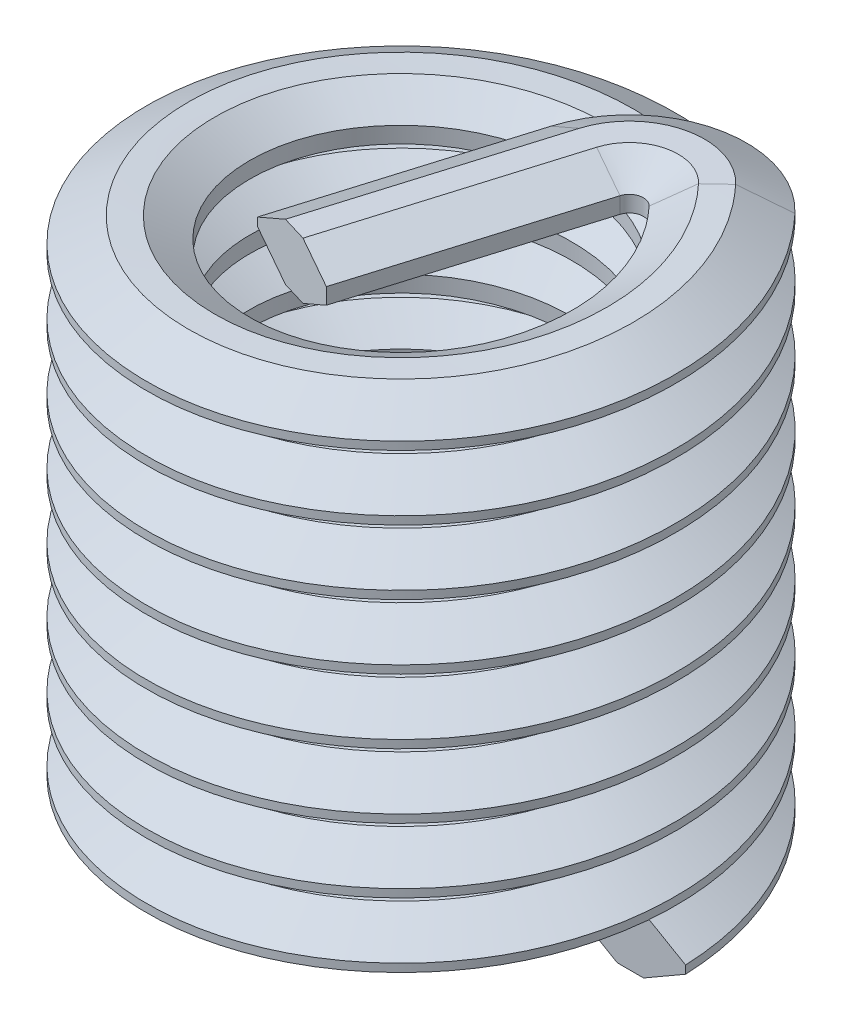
from build123d import *

# Parameters (mm, degrees)
SWEEP1_PITCH       = 0.79375
SWEEP1_HEIGHT      = 6.44525
SWEEP1_RADIUS      = 2.413
SWEEP1_START_ANGLE = 90
REVOLVE1_ANGLE     = 120
EXTRUDE1_DEPTH     = 2.8956


with BuildPart() as part:
    # Sweep1: sweep along a helix
    with BuildLine() as sweep1_path:
        add(Helix(SWEEP1_PITCH, SWEEP1_HEIGHT, SWEEP1_RADIUS, center=(0, 0, 0), direction=(0, 1, 0), mode=Mode.PRIVATE).rotate(Axis((0, 0, 0), (0, 1, 0)), SWEEP1_START_ANGLE))
    # Sketch1 → Sweep1 (sweep)
    with BuildSketch(Plane(origin=(0, 0, 0), x_dir=(-1, 0, 0), z_dir=(0, 0, 1))):
        Polygon((-3.2512, -0.049609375), (-2.735644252, -0.347265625), (-2.413, -0.347265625), (-1.98337021, -0.09921875), (-1.98337021, 0.09921875), (-2.413, 0.347265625), (-2.735644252, 0.347265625), (-3.2512, 0.049609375), align=None)
    sweep(path=sweep1_path.line, is_frenet=True)


with BuildPart() as body_2:
    # Sketch3 → Revolve1 (revolve)
    with BuildSketch(Plane(origin=(0, 0, 0), x_dir=(-0.7289724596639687, 0, 0.6845430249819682), z_dir=(-0.6845430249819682, 0, -0.7289724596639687))):
        Polygon((-2.413, 6.098165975), (-1.98337021, 6.34621285), (-1.98337021, 6.54465057), (-2.413, 6.792697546), (-2.735644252, 6.79269765), (-3.2512, 6.4950414), (-3.2512, 6.395822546), (-2.735644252, 6.098166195), align=None)
    revolve(axis=Axis((1.320546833, 6.445431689, -1.240062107), (-1.1953460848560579e-11, 1.0, 1.122460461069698e-11)), revolution_arc=REVOLVE1_ANGLE)

    # Sketch4 → Extrude1 (add)
    with BuildSketch(Plane(origin=(0.453447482, 0, -1.501860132), x_dir=(0.9573178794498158, -3.586170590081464e-11, 0.2890371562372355), z_dir=(-0.2890371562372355, -1.4197741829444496e-11, 0.9573178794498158))):
        Polygon((-0.018367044, 6.098166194), (0.304277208, 6.098165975), (0.733906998, 6.34621285), (0.733906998, 6.54465057), (0.304277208, 6.792697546), (-0.018367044, 6.79269765), (-0.533922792, 6.4950414), (-0.533922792, 6.395822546), align=None)
    extrude(amount=EXTRUDE1_DEPTH)


solid = Compound([part.part, body_2.part])
